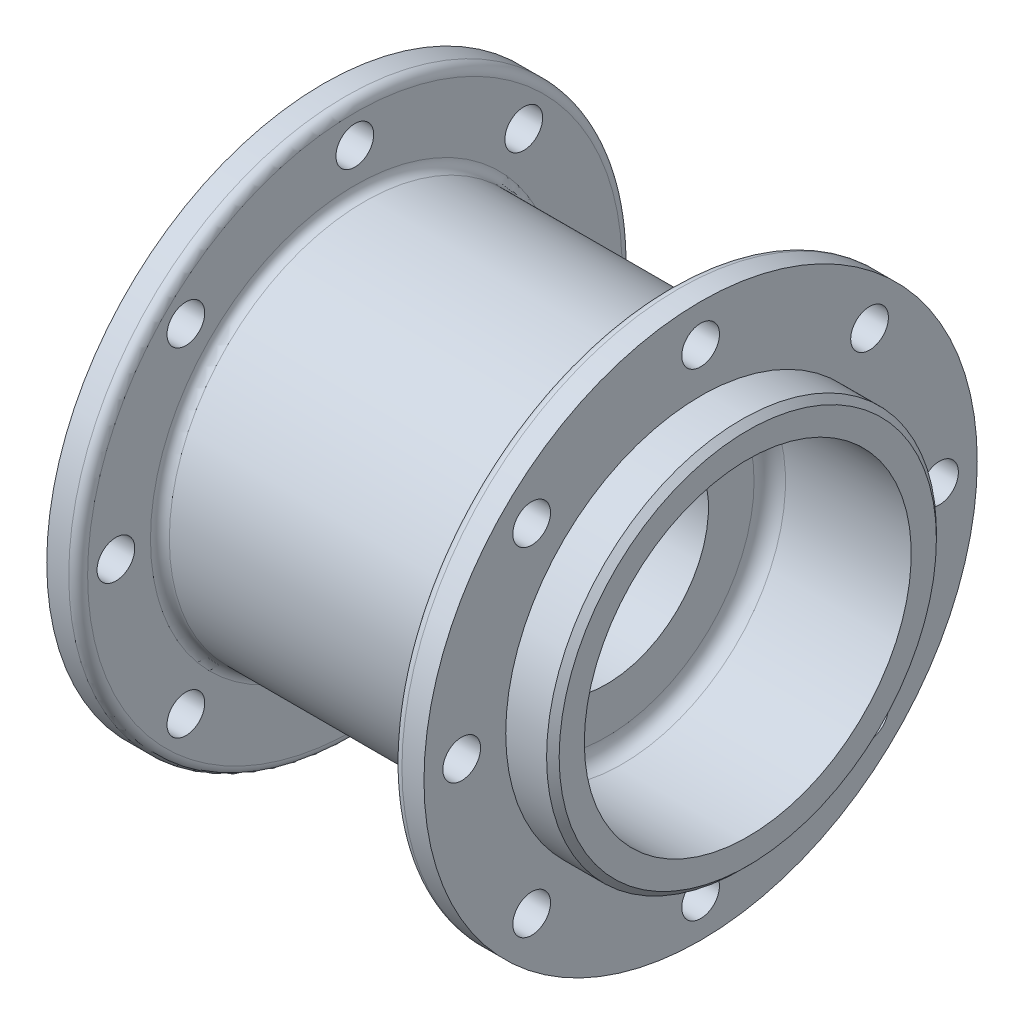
ISO-10303-21;
HEADER;
FILE_DESCRIPTION(('STEP AP214'),'2;1');
FILE_NAME('part.step','',(''),(''),'','','');
FILE_SCHEMA(('AUTOMOTIVE_DESIGN { 1 0 10303 214 1 1 1 1 }'));
ENDSEC;
DATA;
#1=APPLICATION_CONTEXT('core data for automotive mechanical design processes');
#2=APPLICATION_PROTOCOL_DEFINITION('international standard','automotive_design',2000,#1);
#3=PRODUCT_CONTEXT('',#1,'mechanical');
#4=PRODUCT('Part','Part','',(#3));
#5=PRODUCT_RELATED_PRODUCT_CATEGORY('part','',(#4));
#6=PRODUCT_DEFINITION_FORMATION('','',#4);
#7=PRODUCT_DEFINITION_CONTEXT('part definition',#1,'design');
#8=PRODUCT_DEFINITION('design','',#6,#7);
#9=PRODUCT_DEFINITION_SHAPE('','',#8);
#10=(LENGTH_UNIT() NAMED_UNIT(*) SI_UNIT(.MILLI.,.METRE.));
#11=(NAMED_UNIT(*) PLANE_ANGLE_UNIT() SI_UNIT($,.RADIAN.));
#12=(NAMED_UNIT(*) SI_UNIT($,.STERADIAN.) SOLID_ANGLE_UNIT());
#13=UNCERTAINTY_MEASURE_WITH_UNIT(LENGTH_MEASURE(1.E-05),#10,'distance_accuracy_value','');
#14=(GEOMETRIC_REPRESENTATION_CONTEXT(3) GLOBAL_UNCERTAINTY_ASSIGNED_CONTEXT((#13)) GLOBAL_UNIT_ASSIGNED_CONTEXT((#10,
#11,#12)) REPRESENTATION_CONTEXT('',''));
#15=CARTESIAN_POINT('',(0.,0.,0.));
#16=DIRECTION('',(0.,0.,1.));
#17=DIRECTION('',(1.,0.,0.));
#18=AXIS2_PLACEMENT_3D('',#15,#16,#17);
#19=CARTESIAN_POINT('',(0.,62.,0.));
#20=DIRECTION('',(1.,0.,0.));
#21=DIRECTION('',(0.,0.,-1.));
#22=AXIS2_PLACEMENT_3D('',#19,#20,#21);
#23=PLANE('',#22);
#24=CARTESIAN_POINT('',(0.,0.,0.));
#25=DIRECTION('',(1.,0.,0.));
#26=DIRECTION('',(0.,0.,-1.));
#27=AXIS2_PLACEMENT_3D('',#24,#25,#26);
#28=CIRCLE('',#27,60.0000000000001);
#29=CARTESIAN_POINT('',(0.,0.,-60.0000000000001));
#30=VERTEX_POINT('',#29);
#31=EDGE_CURVE('E81',#30,#30,#28,.F.);
#32=ORIENTED_EDGE('',*,*,#31,.T.);
#33=EDGE_LOOP('',(#32));
#34=FACE_BOUND('',#33,.T.);
#35=CARTESIAN_POINT('',(0.,0.,0.));
#36=DIRECTION('',(-1.,0.,0.));
#37=DIRECTION('',(0.,0.,1.));
#38=AXIS2_PLACEMENT_3D('',#35,#36,#37);
#39=CIRCLE('',#38,52.);
#40=CARTESIAN_POINT('',(0.,0.,52.));
#41=VERTEX_POINT('',#40);
#42=EDGE_CURVE('E84',#41,#41,#39,.T.);
#43=ORIENTED_EDGE('',*,*,#42,.F.);
#44=EDGE_LOOP('',(#43));
#45=FACE_BOUND('',#44,.T.);
#46=ADVANCED_FACE('F28',(#34,#45),#23,.F.);
#47=CARTESIAN_POINT('',(-29.1371725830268,0.,0.));
#48=DIRECTION('',(-1.,0.,0.));
#49=DIRECTION('',(0.,0.,1.));
#50=AXIS2_PLACEMENT_3D('',#47,#48,#49);
#51=CYLINDRICAL_SURFACE('',#50,52.);
#52=CARTESIAN_POINT('',(40.,0.,0.));
#53=DIRECTION('',(1.,0.,0.));
#54=DIRECTION('',(0.,0.,-1.));
#55=AXIS2_PLACEMENT_3D('',#52,#53,#54);
#56=CIRCLE('',#55,52.);
#57=CARTESIAN_POINT('',(40.,0.,-52.));
#58=VERTEX_POINT('',#57);
#59=EDGE_CURVE('E10',#58,#58,#56,.T.);
#60=ORIENTED_EDGE('',*,*,#59,.T.);
#61=EDGE_LOOP('',(#60));
#62=FACE_BOUND('',#61,.T.);
#63=ORIENTED_EDGE('',*,*,#42,.T.);
#64=EDGE_LOOP('',(#63));
#65=FACE_BOUND('',#64,.T.);
#66=ADVANCED_FACE('F243',(#62,#65),#51,.F.);
#67=CARTESIAN_POINT('',(45.,52.,0.));
#68=DIRECTION('',(1.,0.,0.));
#69=DIRECTION('',(0.,0.,-1.));
#70=AXIS2_PLACEMENT_3D('',#67,#68,#69);
#71=PLANE('',#70);
#72=CARTESIAN_POINT('',(45.,0.,0.));
#73=DIRECTION('',(1.,0.,0.));
#74=DIRECTION('',(0.,0.,-1.));
#75=AXIS2_PLACEMENT_3D('',#72,#73,#74);
#76=CIRCLE('',#75,47.);
#77=CARTESIAN_POINT('',(45.,0.,-47.));
#78=VERTEX_POINT('',#77);
#79=EDGE_CURVE('E35',#78,#78,#76,.F.);
#80=ORIENTED_EDGE('',*,*,#79,.T.);
#81=EDGE_LOOP('',(#80));
#82=FACE_BOUND('',#81,.T.);
#83=CARTESIAN_POINT('',(45.,0.,0.));
#84=DIRECTION('',(-1.,0.,0.));
#85=DIRECTION('',(0.,0.,1.));
#86=AXIS2_PLACEMENT_3D('',#83,#84,#85);
#87=CIRCLE('',#86,32.5);
#88=CARTESIAN_POINT('',(45.,0.,32.5));
#89=VERTEX_POINT('',#88);
#90=EDGE_CURVE('E87',#89,#89,#87,.T.);
#91=ORIENTED_EDGE('',*,*,#90,.F.);
#92=EDGE_LOOP('',(#91));
#93=FACE_BOUND('',#92,.T.);
#94=ADVANCED_FACE('F249',(#82,#93),#71,.F.);
#95=CARTESIAN_POINT('',(-29.1371725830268,0.,0.));
#96=DIRECTION('',(-1.,0.,0.));
#97=DIRECTION('',(0.,0.,1.));
#98=AXIS2_PLACEMENT_3D('',#95,#96,#97);
#99=CYLINDRICAL_SURFACE('',#98,32.5);
#100=CARTESIAN_POINT('',(105.,0.,0.));
#101=DIRECTION('',(-1.,0.,0.));
#102=DIRECTION('',(0.,0.,1.));
#103=AXIS2_PLACEMENT_3D('',#100,#101,#102);
#104=CIRCLE('',#103,32.5);
#105=CARTESIAN_POINT('',(105.,0.,32.5));
#106=VERTEX_POINT('',#105);
#107=EDGE_CURVE('E90',#106,#106,#104,.T.);
#108=ORIENTED_EDGE('',*,*,#107,.F.);
#109=EDGE_LOOP('',(#108));
#110=FACE_BOUND('',#109,.T.);
#111=ORIENTED_EDGE('',*,*,#90,.T.);
#112=EDGE_LOOP('',(#111));
#113=FACE_BOUND('',#112,.T.);
#114=ADVANCED_FACE('F315',(#110,#113),#99,.F.);
#115=CARTESIAN_POINT('',(105.,32.5,0.));
#116=DIRECTION('',(-1.,0.,0.));
#117=DIRECTION('',(0.,0.,1.));
#118=AXIS2_PLACEMENT_3D('',#115,#116,#117);
#119=PLANE('',#118);
#120=CARTESIAN_POINT('',(105.,0.,0.));
#121=DIRECTION('',(-1.,0.,0.));
#122=DIRECTION('',(0.,0.,1.));
#123=AXIS2_PLACEMENT_3D('',#120,#121,#122);
#124=CIRCLE('',#123,47.);
#125=CARTESIAN_POINT('',(105.,0.,47.));
#126=VERTEX_POINT('',#125);
#127=EDGE_CURVE('E39',#126,#126,#124,.F.);
#128=ORIENTED_EDGE('',*,*,#127,.T.);
#129=EDGE_LOOP('',(#128));
#130=FACE_BOUND('',#129,.T.);
#131=ORIENTED_EDGE('',*,*,#107,.T.);
#132=EDGE_LOOP('',(#131));
#133=FACE_BOUND('',#132,.T.);
#134=ADVANCED_FACE('F297',(#130,#133),#119,.F.);
#135=CARTESIAN_POINT('',(-29.1371725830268,0.,0.));
#136=DIRECTION('',(-1.,0.,0.));
#137=DIRECTION('',(0.,0.,1.));
#138=AXIS2_PLACEMENT_3D('',#135,#136,#137);
#139=CYLINDRICAL_SURFACE('',#138,52.);
#140=CARTESIAN_POINT('',(110.,0.,0.));
#141=DIRECTION('',(-1.,0.,0.));
#142=DIRECTION('',(0.,0.,1.));
#143=AXIS2_PLACEMENT_3D('',#140,#141,#142);
#144=CIRCLE('',#143,52.);
#145=CARTESIAN_POINT('',(110.,0.,52.));
#146=VERTEX_POINT('',#145);
#147=EDGE_CURVE('E43',#146,#146,#144,.T.);
#148=ORIENTED_EDGE('',*,*,#147,.T.);
#149=EDGE_LOOP('',(#148));
#150=FACE_BOUND('',#149,.T.);
#151=CARTESIAN_POINT('',(150.,0.,0.));
#152=DIRECTION('',(-1.,0.,0.));
#153=DIRECTION('',(0.,0.,1.));
#154=AXIS2_PLACEMENT_3D('',#151,#152,#153);
#155=CIRCLE('',#154,52.);
#156=CARTESIAN_POINT('',(150.,0.,52.));
#157=VERTEX_POINT('',#156);
#158=EDGE_CURVE('E93',#157,#157,#155,.T.);
#159=ORIENTED_EDGE('',*,*,#158,.F.);
#160=EDGE_LOOP('',(#159));
#161=FACE_BOUND('',#160,.T.);
#162=ADVANCED_FACE('F293',(#150,#161),#139,.F.);
#163=CARTESIAN_POINT('',(150.,62.,0.));
#164=DIRECTION('',(-1.,0.,0.));
#165=DIRECTION('',(0.,0.,1.));
#166=AXIS2_PLACEMENT_3D('',#163,#164,#165);
#167=PLANE('',#166);
#168=CARTESIAN_POINT('',(150.,0.,0.));
#169=DIRECTION('',(-1.,0.,0.));
#170=DIRECTION('',(0.,0.,1.));
#171=AXIS2_PLACEMENT_3D('',#168,#169,#170);
#172=CIRCLE('',#171,60.);
#173=CARTESIAN_POINT('',(150.,0.,60.));
#174=VERTEX_POINT('',#173);
#175=EDGE_CURVE('E72',#174,#174,#172,.F.);
#176=ORIENTED_EDGE('',*,*,#175,.T.);
#177=EDGE_LOOP('',(#176));
#178=FACE_BOUND('',#177,.T.);
#179=ORIENTED_EDGE('',*,*,#158,.T.);
#180=EDGE_LOOP('',(#179));
#181=FACE_BOUND('',#180,.T.);
#182=ADVANCED_FACE('F296',(#178,#181),#167,.F.);
#183=CARTESIAN_POINT('',(-29.1371725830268,0.,0.));
#184=DIRECTION('',(-1.,0.,0.));
#185=DIRECTION('',(0.,0.,1.));
#186=AXIS2_PLACEMENT_3D('',#183,#184,#185);
#187=CYLINDRICAL_SURFACE('',#186,62.);
#188=CARTESIAN_POINT('',(148.,0.,0.));
#189=DIRECTION('',(-1.,0.,0.));
#190=DIRECTION('',(0.,0.,1.));
#191=AXIS2_PLACEMENT_3D('',#188,#189,#190);
#192=CIRCLE('',#191,62.);
#193=CARTESIAN_POINT('',(148.,0.,62.));
#194=VERTEX_POINT('',#193);
#195=EDGE_CURVE('E75',#194,#194,#192,.T.);
#196=ORIENTED_EDGE('',*,*,#195,.T.);
#197=EDGE_LOOP('',(#196));
#198=FACE_BOUND('',#197,.T.);
#199=CARTESIAN_POINT('',(135.,0.,0.));
#200=DIRECTION('',(-1.,0.,0.));
#201=DIRECTION('',(0.,0.,1.));
#202=AXIS2_PLACEMENT_3D('',#199,#200,#201);
#203=CIRCLE('',#202,62.);
#204=CARTESIAN_POINT('',(135.,0.,62.));
#205=VERTEX_POINT('',#204);
#206=EDGE_CURVE('E96',#205,#205,#203,.T.);
#207=ORIENTED_EDGE('',*,*,#206,.F.);
#208=EDGE_LOOP('',(#207));
#209=FACE_BOUND('',#208,.T.);
#210=ADVANCED_FACE('F302',(#198,#209),#187,.T.);
#211=CARTESIAN_POINT('',(135.,88.,0.));
#212=DIRECTION('',(-1.,0.,0.));
#213=DIRECTION('',(0.,0.,1.));
#214=AXIS2_PLACEMENT_3D('',#211,#212,#213);
#215=PLANE('',#214);
#216=CARTESIAN_POINT('',(135.,0.,-76.));
#217=DIRECTION('',(-1.,0.,0.));
#218=DIRECTION('',(0.,0.,1.));
#219=AXIS2_PLACEMENT_3D('',#216,#217,#218);
#220=CIRCLE('',#219,6.);
#221=CARTESIAN_POINT('',(135.,0.,-70.));
#222=VERTEX_POINT('',#221);
#223=EDGE_CURVE('E192',#222,#222,#220,.T.);
#224=ORIENTED_EDGE('',*,*,#223,.T.);
#225=EDGE_LOOP('',(#224));
#226=FACE_BOUND('',#225,.T.);
#227=CARTESIAN_POINT('',(135.,-53.7401153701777,-53.7401153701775));
#228=DIRECTION('',(-1.,0.,0.));
#229=DIRECTION('',(0.,0.,1.));
#230=AXIS2_PLACEMENT_3D('',#227,#228,#229);
#231=CIRCLE('',#230,6.);
#232=CARTESIAN_POINT('',(135.,-53.7401153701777,-47.7401153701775));
#233=VERTEX_POINT('',#232);
#234=EDGE_CURVE('E180',#233,#233,#231,.T.);
#235=ORIENTED_EDGE('',*,*,#234,.T.);
#236=EDGE_LOOP('',(#235));
#237=FACE_BOUND('',#236,.T.);
#238=CARTESIAN_POINT('',(135.,-76.,0.));
#239=DIRECTION('',(-1.,0.,0.));
#240=DIRECTION('',(0.,0.,1.));
#241=AXIS2_PLACEMENT_3D('',#238,#239,#240);
#242=CIRCLE('',#241,6.);
#243=CARTESIAN_POINT('',(135.,-76.,6.));
#244=VERTEX_POINT('',#243);
#245=EDGE_CURVE('E168',#244,#244,#242,.T.);
#246=ORIENTED_EDGE('',*,*,#245,.T.);
#247=EDGE_LOOP('',(#246));
#248=FACE_BOUND('',#247,.T.);
#249=CARTESIAN_POINT('',(135.,-53.7401153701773,53.7401153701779));
#250=DIRECTION('',(-1.,0.,0.));
#251=DIRECTION('',(0.,0.,1.));
#252=AXIS2_PLACEMENT_3D('',#249,#250,#251);
#253=CIRCLE('',#252,6.00000000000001);
#254=CARTESIAN_POINT('',(135.,-53.7401153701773,59.7401153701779));
#255=VERTEX_POINT('',#254);
#256=EDGE_CURVE('E156',#255,#255,#253,.T.);
#257=ORIENTED_EDGE('',*,*,#256,.T.);
#258=EDGE_LOOP('',(#257));
#259=FACE_BOUND('',#258,.T.);
#260=CARTESIAN_POINT('',(135.,0.,76.));
#261=DIRECTION('',(-1.,0.,0.));
#262=DIRECTION('',(0.,0.,1.));
#263=AXIS2_PLACEMENT_3D('',#260,#261,#262);
#264=CIRCLE('',#263,6.);
#265=CARTESIAN_POINT('',(135.,0.,82.));
#266=VERTEX_POINT('',#265);
#267=EDGE_CURVE('E144',#266,#266,#264,.T.);
#268=ORIENTED_EDGE('',*,*,#267,.T.);
#269=EDGE_LOOP('',(#268));
#270=FACE_BOUND('',#269,.T.);
#271=CARTESIAN_POINT('',(135.,53.7401153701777,53.7401153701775));
#272=DIRECTION('',(-1.,0.,0.));
#273=DIRECTION('',(0.,0.,1.));
#274=AXIS2_PLACEMENT_3D('',#271,#272,#273);
#275=CIRCLE('',#274,5.99999999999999);
#276=CARTESIAN_POINT('',(135.,53.7401153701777,59.7401153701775));
#277=VERTEX_POINT('',#276);
#278=EDGE_CURVE('E132',#277,#277,#275,.T.);
#279=ORIENTED_EDGE('',*,*,#278,.T.);
#280=EDGE_LOOP('',(#279));
#281=FACE_BOUND('',#280,.T.);
#282=CARTESIAN_POINT('',(135.,76.,0.));
#283=DIRECTION('',(-1.,0.,0.));
#284=DIRECTION('',(0.,0.,1.));
#285=AXIS2_PLACEMENT_3D('',#282,#283,#284);
#286=CIRCLE('',#285,6.);
#287=CARTESIAN_POINT('',(135.,76.,6.));
#288=VERTEX_POINT('',#287);
#289=EDGE_CURVE('E120',#288,#288,#286,.T.);
#290=ORIENTED_EDGE('',*,*,#289,.T.);
#291=EDGE_LOOP('',(#290));
#292=FACE_BOUND('',#291,.T.);
#293=CARTESIAN_POINT('',(135.,53.7401153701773,-53.7401153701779));
#294=DIRECTION('',(-1.,0.,0.));
#295=DIRECTION('',(0.,0.,1.));
#296=AXIS2_PLACEMENT_3D('',#293,#294,#295);
#297=CIRCLE('',#296,5.99999999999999);
#298=CARTESIAN_POINT('',(135.,53.7401153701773,-47.7401153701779));
#299=VERTEX_POINT('',#298);
#300=EDGE_CURVE('E108',#299,#299,#297,.T.);
#301=ORIENTED_EDGE('',*,*,#300,.T.);
#302=EDGE_LOOP('',(#301));
#303=FACE_BOUND('',#302,.T.);
#304=CARTESIAN_POINT('',(135.,0.,0.));
#305=DIRECTION('',(-1.,0.,0.));
#306=DIRECTION('',(0.,0.,1.));
#307=AXIS2_PLACEMENT_3D('',#304,#305,#306);
#308=CIRCLE('',#307,88.);
#309=CARTESIAN_POINT('',(135.,0.,88.));
#310=VERTEX_POINT('',#309);
#311=EDGE_CURVE('E99',#310,#310,#308,.T.);
#312=ORIENTED_EDGE('',*,*,#311,.F.);
#313=EDGE_LOOP('',(#312));
#314=FACE_BOUND('',#313,.T.);
#315=ORIENTED_EDGE('',*,*,#206,.T.);
#316=EDGE_LOOP('',(#315));
#317=FACE_BOUND('',#316,.T.);
#318=ADVANCED_FACE('F308',(#226,#237,#248,#259,#270,#281,#292,#303,#314,#317),#215,.F.);
#319=CARTESIAN_POINT('',(-29.1371725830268,0.,0.));
#320=DIRECTION('',(-1.,0.,0.));
#321=DIRECTION('',(0.,0.,1.));
#322=AXIS2_PLACEMENT_3D('',#319,#320,#321);
#323=CYLINDRICAL_SURFACE('',#322,88.);
#324=CARTESIAN_POINT('',(128.,0.,0.));
#325=DIRECTION('',(1.,0.,0.));
#326=DIRECTION('',(0.,0.,-1.));
#327=AXIS2_PLACEMENT_3D('',#324,#325,#326);
#328=CIRCLE('',#327,88.);
#329=CARTESIAN_POINT('',(128.,0.,-88.));
#330=VERTEX_POINT('',#329);
#331=EDGE_CURVE('E63',#330,#330,#328,.T.);
#332=ORIENTED_EDGE('',*,*,#331,.T.);
#333=EDGE_LOOP('',(#332));
#334=FACE_BOUND('',#333,.T.);
#335=ORIENTED_EDGE('',*,*,#311,.T.);
#336=EDGE_LOOP('',(#335));
#337=FACE_BOUND('',#336,.T.);
#338=ADVANCED_FACE('F553',(#334,#337),#323,.T.);
#339=CARTESIAN_POINT('',(125.,62.,0.));
#340=DIRECTION('',(1.,0.,0.));
#341=DIRECTION('',(0.,0.,-1.));
#342=AXIS2_PLACEMENT_3D('',#339,#340,#341);
#343=PLANE('',#342);
#344=CARTESIAN_POINT('',(125.,0.,-76.));
#345=DIRECTION('',(1.,0.,0.));
#346=DIRECTION('',(0.,0.,-1.));
#347=AXIS2_PLACEMENT_3D('',#344,#345,#346);
#348=CIRCLE('',#347,6.);
#349=CARTESIAN_POINT('',(125.,0.,-82.));
#350=VERTEX_POINT('',#349);
#351=EDGE_CURVE('E195',#350,#350,#348,.T.);
#352=ORIENTED_EDGE('',*,*,#351,.T.);
#353=EDGE_LOOP('',(#352));
#354=FACE_BOUND('',#353,.T.);
#355=CARTESIAN_POINT('',(125.,-53.7401153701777,-53.7401153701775));
#356=DIRECTION('',(1.,0.,0.));
#357=DIRECTION('',(0.,0.,-1.));
#358=AXIS2_PLACEMENT_3D('',#355,#356,#357);
#359=CIRCLE('',#358,6.);
#360=CARTESIAN_POINT('',(125.,-53.7401153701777,-59.7401153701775));
#361=VERTEX_POINT('',#360);
#362=EDGE_CURVE('E183',#361,#361,#359,.T.);
#363=ORIENTED_EDGE('',*,*,#362,.T.);
#364=EDGE_LOOP('',(#363));
#365=FACE_BOUND('',#364,.T.);
#366=CARTESIAN_POINT('',(125.,-76.,0.));
#367=DIRECTION('',(1.,0.,0.));
#368=DIRECTION('',(0.,0.,-1.));
#369=AXIS2_PLACEMENT_3D('',#366,#367,#368);
#370=CIRCLE('',#369,6.);
#371=CARTESIAN_POINT('',(125.,-76.,-6.));
#372=VERTEX_POINT('',#371);
#373=EDGE_CURVE('E171',#372,#372,#370,.T.);
#374=ORIENTED_EDGE('',*,*,#373,.T.);
#375=EDGE_LOOP('',(#374));
#376=FACE_BOUND('',#375,.T.);
#377=CARTESIAN_POINT('',(125.,-53.7401153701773,53.7401153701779));
#378=DIRECTION('',(1.,0.,0.));
#379=DIRECTION('',(0.,0.,-1.));
#380=AXIS2_PLACEMENT_3D('',#377,#378,#379);
#381=CIRCLE('',#380,6.00000000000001);
#382=CARTESIAN_POINT('',(125.,-53.7401153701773,47.7401153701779));
#383=VERTEX_POINT('',#382);
#384=EDGE_CURVE('E159',#383,#383,#381,.T.);
#385=ORIENTED_EDGE('',*,*,#384,.T.);
#386=EDGE_LOOP('',(#385));
#387=FACE_BOUND('',#386,.T.);
#388=CARTESIAN_POINT('',(125.,0.,76.));
#389=DIRECTION('',(1.,0.,0.));
#390=DIRECTION('',(0.,0.,-1.));
#391=AXIS2_PLACEMENT_3D('',#388,#389,#390);
#392=CIRCLE('',#391,6.);
#393=CARTESIAN_POINT('',(125.,0.,70.));
#394=VERTEX_POINT('',#393);
#395=EDGE_CURVE('E147',#394,#394,#392,.T.);
#396=ORIENTED_EDGE('',*,*,#395,.T.);
#397=EDGE_LOOP('',(#396));
#398=FACE_BOUND('',#397,.T.);
#399=CARTESIAN_POINT('',(125.,53.7401153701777,53.7401153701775));
#400=DIRECTION('',(1.,0.,0.));
#401=DIRECTION('',(0.,0.,-1.));
#402=AXIS2_PLACEMENT_3D('',#399,#400,#401);
#403=CIRCLE('',#402,5.99999999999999);
#404=CARTESIAN_POINT('',(125.,53.7401153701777,47.7401153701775));
#405=VERTEX_POINT('',#404);
#406=EDGE_CURVE('E135',#405,#405,#403,.T.);
#407=ORIENTED_EDGE('',*,*,#406,.T.);
#408=EDGE_LOOP('',(#407));
#409=FACE_BOUND('',#408,.T.);
#410=CARTESIAN_POINT('',(125.,76.,0.));
#411=DIRECTION('',(1.,0.,0.));
#412=DIRECTION('',(0.,0.,-1.));
#413=AXIS2_PLACEMENT_3D('',#410,#411,#412);
#414=CIRCLE('',#413,6.);
#415=CARTESIAN_POINT('',(125.,76.,-6.));
#416=VERTEX_POINT('',#415);
#417=EDGE_CURVE('E123',#416,#416,#414,.T.);
#418=ORIENTED_EDGE('',*,*,#417,.T.);
#419=EDGE_LOOP('',(#418));
#420=FACE_BOUND('',#419,.T.);
#421=CARTESIAN_POINT('',(125.,53.7401153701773,-53.7401153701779));
#422=DIRECTION('',(1.,0.,0.));
#423=DIRECTION('',(0.,0.,-1.));
#424=AXIS2_PLACEMENT_3D('',#421,#422,#423);
#425=CIRCLE('',#424,5.99999999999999);
#426=CARTESIAN_POINT('',(125.,53.7401153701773,-59.7401153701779));
#427=VERTEX_POINT('',#426);
#428=EDGE_CURVE('E111',#427,#427,#425,.T.);
#429=ORIENTED_EDGE('',*,*,#428,.T.);
#430=EDGE_LOOP('',(#429));
#431=FACE_BOUND('',#430,.T.);
#432=CARTESIAN_POINT('',(125.,0.,0.));
#433=DIRECTION('',(1.,0.,0.));
#434=DIRECTION('',(0.,0.,-1.));
#435=AXIS2_PLACEMENT_3D('',#432,#433,#434);
#436=CIRCLE('',#435,85.);
#437=CARTESIAN_POINT('',(125.,0.,-85.));
#438=VERTEX_POINT('',#437);
#439=EDGE_CURVE('E66',#438,#438,#436,.F.);
#440=ORIENTED_EDGE('',*,*,#439,.T.);
#441=EDGE_LOOP('',(#440));
#442=FACE_BOUND('',#441,.T.);
#443=CARTESIAN_POINT('',(125.,0.,0.));
#444=DIRECTION('',(1.,0.,0.));
#445=DIRECTION('',(0.,0.,-1.));
#446=AXIS2_PLACEMENT_3D('',#443,#444,#445);
#447=CIRCLE('',#446,65.);
#448=CARTESIAN_POINT('',(125.,0.,-65.));
#449=VERTEX_POINT('',#448);
#450=EDGE_CURVE('E69',#449,#449,#447,.T.);
#451=ORIENTED_EDGE('',*,*,#450,.T.);
#452=EDGE_LOOP('',(#451));
#453=FACE_BOUND('',#452,.T.);
#454=ADVANCED_FACE('F545',(#354,#365,#376,#387,#398,#409,#420,#431,#442,#453),#343,.F.);
#455=CARTESIAN_POINT('',(-29.1371725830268,0.,0.));
#456=DIRECTION('',(-1.,0.,0.));
#457=DIRECTION('',(0.,0.,1.));
#458=AXIS2_PLACEMENT_3D('',#455,#456,#457);
#459=CYLINDRICAL_SURFACE('',#458,62.);
#460=CARTESIAN_POINT('',(122.,0.,0.));
#461=DIRECTION('',(1.,0.,0.));
#462=DIRECTION('',(0.,0.,-1.));
#463=AXIS2_PLACEMENT_3D('',#460,#461,#462);
#464=CIRCLE('',#463,62.);
#465=CARTESIAN_POINT('',(122.,0.,-62.));
#466=VERTEX_POINT('',#465);
#467=EDGE_CURVE('E48',#466,#466,#464,.F.);
#468=ORIENTED_EDGE('',*,*,#467,.T.);
#469=EDGE_LOOP('',(#468));
#470=FACE_BOUND('',#469,.T.);
#471=CARTESIAN_POINT('',(28.,0.,0.));
#472=DIRECTION('',(-1.,0.,0.));
#473=DIRECTION('',(0.,0.,1.));
#474=AXIS2_PLACEMENT_3D('',#471,#472,#473);
#475=CIRCLE('',#474,62.);
#476=CARTESIAN_POINT('',(28.,0.,62.));
#477=VERTEX_POINT('',#476);
#478=EDGE_CURVE('E51',#477,#477,#475,.F.);
#479=ORIENTED_EDGE('',*,*,#478,.T.);
#480=EDGE_LOOP('',(#479));
#481=FACE_BOUND('',#480,.T.);
#482=ADVANCED_FACE('F239',(#470,#481),#459,.T.);
#483=CARTESIAN_POINT('',(25.,88.,0.));
#484=DIRECTION('',(-1.,0.,0.));
#485=DIRECTION('',(0.,0.,1.));
#486=AXIS2_PLACEMENT_3D('',#483,#484,#485);
#487=PLANE('',#486);
#488=CARTESIAN_POINT('',(25.,0.,-76.));
#489=DIRECTION('',(-1.,0.,0.));
#490=DIRECTION('',(0.,0.,1.));
#491=AXIS2_PLACEMENT_3D('',#488,#489,#490);
#492=CIRCLE('',#491,6.);
#493=CARTESIAN_POINT('',(25.,0.,-70.));
#494=VERTEX_POINT('',#493);
#495=EDGE_CURVE('E198',#494,#494,#492,.T.);
#496=ORIENTED_EDGE('',*,*,#495,.T.);
#497=EDGE_LOOP('',(#496));
#498=FACE_BOUND('',#497,.T.);
#499=CARTESIAN_POINT('',(25.,-53.7401153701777,-53.7401153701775));
#500=DIRECTION('',(-1.,0.,0.));
#501=DIRECTION('',(0.,0.,1.));
#502=AXIS2_PLACEMENT_3D('',#499,#500,#501);
#503=CIRCLE('',#502,6.);
#504=CARTESIAN_POINT('',(25.,-53.7401153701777,-47.7401153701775));
#505=VERTEX_POINT('',#504);
#506=EDGE_CURVE('E186',#505,#505,#503,.T.);
#507=ORIENTED_EDGE('',*,*,#506,.T.);
#508=EDGE_LOOP('',(#507));
#509=FACE_BOUND('',#508,.T.);
#510=CARTESIAN_POINT('',(25.,-76.,0.));
#511=DIRECTION('',(-1.,0.,0.));
#512=DIRECTION('',(0.,0.,1.));
#513=AXIS2_PLACEMENT_3D('',#510,#511,#512);
#514=CIRCLE('',#513,6.);
#515=CARTESIAN_POINT('',(25.,-76.,6.));
#516=VERTEX_POINT('',#515);
#517=EDGE_CURVE('E174',#516,#516,#514,.T.);
#518=ORIENTED_EDGE('',*,*,#517,.T.);
#519=EDGE_LOOP('',(#518));
#520=FACE_BOUND('',#519,.T.);
#521=CARTESIAN_POINT('',(25.,-53.7401153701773,53.7401153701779));
#522=DIRECTION('',(-1.,0.,0.));
#523=DIRECTION('',(0.,0.,1.));
#524=AXIS2_PLACEMENT_3D('',#521,#522,#523);
#525=CIRCLE('',#524,6.00000000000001);
#526=CARTESIAN_POINT('',(25.,-53.7401153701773,59.7401153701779));
#527=VERTEX_POINT('',#526);
#528=EDGE_CURVE('E162',#527,#527,#525,.T.);
#529=ORIENTED_EDGE('',*,*,#528,.T.);
#530=EDGE_LOOP('',(#529));
#531=FACE_BOUND('',#530,.T.);
#532=CARTESIAN_POINT('',(25.,0.,76.));
#533=DIRECTION('',(-1.,0.,0.));
#534=DIRECTION('',(0.,0.,1.));
#535=AXIS2_PLACEMENT_3D('',#532,#533,#534);
#536=CIRCLE('',#535,6.);
#537=CARTESIAN_POINT('',(25.,0.,82.));
#538=VERTEX_POINT('',#537);
#539=EDGE_CURVE('E150',#538,#538,#536,.T.);
#540=ORIENTED_EDGE('',*,*,#539,.T.);
#541=EDGE_LOOP('',(#540));
#542=FACE_BOUND('',#541,.T.);
#543=CARTESIAN_POINT('',(25.,53.7401153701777,53.7401153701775));
#544=DIRECTION('',(-1.,0.,0.));
#545=DIRECTION('',(0.,0.,1.));
#546=AXIS2_PLACEMENT_3D('',#543,#544,#545);
#547=CIRCLE('',#546,5.99999999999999);
#548=CARTESIAN_POINT('',(25.,53.7401153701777,59.7401153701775));
#549=VERTEX_POINT('',#548);
#550=EDGE_CURVE('E138',#549,#549,#547,.T.);
#551=ORIENTED_EDGE('',*,*,#550,.T.);
#552=EDGE_LOOP('',(#551));
#553=FACE_BOUND('',#552,.T.);
#554=CARTESIAN_POINT('',(25.,76.,0.));
#555=DIRECTION('',(-1.,0.,0.));
#556=DIRECTION('',(0.,0.,1.));
#557=AXIS2_PLACEMENT_3D('',#554,#555,#556);
#558=CIRCLE('',#557,6.);
#559=CARTESIAN_POINT('',(25.,76.,6.));
#560=VERTEX_POINT('',#559);
#561=EDGE_CURVE('E126',#560,#560,#558,.T.);
#562=ORIENTED_EDGE('',*,*,#561,.T.);
#563=EDGE_LOOP('',(#562));
#564=FACE_BOUND('',#563,.T.);
#565=CARTESIAN_POINT('',(25.,53.7401153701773,-53.7401153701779));
#566=DIRECTION('',(-1.,0.,0.));
#567=DIRECTION('',(0.,0.,1.));
#568=AXIS2_PLACEMENT_3D('',#565,#566,#567);
#569=CIRCLE('',#568,5.99999999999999);
#570=CARTESIAN_POINT('',(25.,53.7401153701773,-47.7401153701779));
#571=VERTEX_POINT('',#570);
#572=EDGE_CURVE('E114',#571,#571,#569,.T.);
#573=ORIENTED_EDGE('',*,*,#572,.T.);
#574=EDGE_LOOP('',(#573));
#575=FACE_BOUND('',#574,.T.);
#576=CARTESIAN_POINT('',(25.,0.,0.));
#577=DIRECTION('',(-1.,0.,0.));
#578=DIRECTION('',(0.,0.,1.));
#579=AXIS2_PLACEMENT_3D('',#576,#577,#578);
#580=CIRCLE('',#579,85.);
#581=CARTESIAN_POINT('',(25.,0.,85.));
#582=VERTEX_POINT('',#581);
#583=EDGE_CURVE('E54',#582,#582,#580,.F.);
#584=ORIENTED_EDGE('',*,*,#583,.T.);
#585=EDGE_LOOP('',(#584));
#586=FACE_BOUND('',#585,.T.);
#587=CARTESIAN_POINT('',(25.,0.,0.));
#588=DIRECTION('',(-1.,0.,0.));
#589=DIRECTION('',(0.,0.,1.));
#590=AXIS2_PLACEMENT_3D('',#587,#588,#589);
#591=CIRCLE('',#590,65.);
#592=CARTESIAN_POINT('',(25.,0.,65.));
#593=VERTEX_POINT('',#592);
#594=EDGE_CURVE('E57',#593,#593,#591,.T.);
#595=ORIENTED_EDGE('',*,*,#594,.T.);
#596=EDGE_LOOP('',(#595));
#597=FACE_BOUND('',#596,.T.);
#598=ADVANCED_FACE('F233',(#498,#509,#520,#531,#542,#553,#564,#575,#586,#597),#487,.F.);
#599=CARTESIAN_POINT('',(-29.1371725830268,0.,0.));
#600=DIRECTION('',(-1.,0.,0.));
#601=DIRECTION('',(0.,0.,1.));
#602=AXIS2_PLACEMENT_3D('',#599,#600,#601);
#603=CYLINDRICAL_SURFACE('',#602,88.);
#604=CARTESIAN_POINT('',(22.,0.,0.));
#605=DIRECTION('',(-1.,0.,0.));
#606=DIRECTION('',(0.,0.,1.));
#607=AXIS2_PLACEMENT_3D('',#604,#605,#606);
#608=CIRCLE('',#607,88.);
#609=CARTESIAN_POINT('',(22.,0.,88.));
#610=VERTEX_POINT('',#609);
#611=EDGE_CURVE('E60',#610,#610,#608,.T.);
#612=ORIENTED_EDGE('',*,*,#611,.T.);
#613=EDGE_LOOP('',(#612));
#614=FACE_BOUND('',#613,.T.);
#615=CARTESIAN_POINT('',(15.,0.,0.));
#616=DIRECTION('',(-1.,0.,0.));
#617=DIRECTION('',(0.,0.,1.));
#618=AXIS2_PLACEMENT_3D('',#615,#616,#617);
#619=CIRCLE('',#618,88.);
#620=CARTESIAN_POINT('',(15.,0.,88.));
#621=VERTEX_POINT('',#620);
#622=EDGE_CURVE('E102',#621,#621,#619,.T.);
#623=ORIENTED_EDGE('',*,*,#622,.F.);
#624=EDGE_LOOP('',(#623));
#625=FACE_BOUND('',#624,.T.);
#626=ADVANCED_FACE('F212',(#614,#625),#603,.T.);
#627=CARTESIAN_POINT('',(15.,62.,0.));
#628=DIRECTION('',(1.,0.,0.));
#629=DIRECTION('',(0.,0.,-1.));
#630=AXIS2_PLACEMENT_3D('',#627,#628,#629);
#631=PLANE('',#630);
#632=CARTESIAN_POINT('',(15.,0.,-76.));
#633=DIRECTION('',(-1.,0.,0.));
#634=DIRECTION('',(0.,0.,1.));
#635=AXIS2_PLACEMENT_3D('',#632,#633,#634);
#636=CIRCLE('',#635,6.);
#637=CARTESIAN_POINT('',(15.,0.,-70.));
#638=VERTEX_POINT('',#637);
#639=EDGE_CURVE('E201',#638,#638,#636,.T.);
#640=ORIENTED_EDGE('',*,*,#639,.F.);
#641=EDGE_LOOP('',(#640));
#642=FACE_BOUND('',#641,.T.);
#643=CARTESIAN_POINT('',(15.,-53.7401153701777,-53.7401153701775));
#644=DIRECTION('',(-1.,0.,0.));
#645=DIRECTION('',(0.,0.,1.));
#646=AXIS2_PLACEMENT_3D('',#643,#644,#645);
#647=CIRCLE('',#646,6.);
#648=CARTESIAN_POINT('',(15.,-53.7401153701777,-47.7401153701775));
#649=VERTEX_POINT('',#648);
#650=EDGE_CURVE('E189',#649,#649,#647,.T.);
#651=ORIENTED_EDGE('',*,*,#650,.F.);
#652=EDGE_LOOP('',(#651));
#653=FACE_BOUND('',#652,.T.);
#654=CARTESIAN_POINT('',(15.,-76.,0.));
#655=DIRECTION('',(-1.,0.,0.));
#656=DIRECTION('',(0.,0.,1.));
#657=AXIS2_PLACEMENT_3D('',#654,#655,#656);
#658=CIRCLE('',#657,6.);
#659=CARTESIAN_POINT('',(15.,-76.,6.));
#660=VERTEX_POINT('',#659);
#661=EDGE_CURVE('E177',#660,#660,#658,.T.);
#662=ORIENTED_EDGE('',*,*,#661,.F.);
#663=EDGE_LOOP('',(#662));
#664=FACE_BOUND('',#663,.T.);
#665=CARTESIAN_POINT('',(15.,-53.7401153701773,53.7401153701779));
#666=DIRECTION('',(-1.,0.,0.));
#667=DIRECTION('',(0.,0.,1.));
#668=AXIS2_PLACEMENT_3D('',#665,#666,#667);
#669=CIRCLE('',#668,6.00000000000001);
#670=CARTESIAN_POINT('',(15.,-53.7401153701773,59.7401153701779));
#671=VERTEX_POINT('',#670);
#672=EDGE_CURVE('E165',#671,#671,#669,.T.);
#673=ORIENTED_EDGE('',*,*,#672,.F.);
#674=EDGE_LOOP('',(#673));
#675=FACE_BOUND('',#674,.T.);
#676=CARTESIAN_POINT('',(15.,0.,76.));
#677=DIRECTION('',(-1.,0.,0.));
#678=DIRECTION('',(0.,0.,1.));
#679=AXIS2_PLACEMENT_3D('',#676,#677,#678);
#680=CIRCLE('',#679,6.);
#681=CARTESIAN_POINT('',(15.,0.,82.));
#682=VERTEX_POINT('',#681);
#683=EDGE_CURVE('E153',#682,#682,#680,.T.);
#684=ORIENTED_EDGE('',*,*,#683,.F.);
#685=EDGE_LOOP('',(#684));
#686=FACE_BOUND('',#685,.T.);
#687=CARTESIAN_POINT('',(15.,53.7401153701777,53.7401153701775));
#688=DIRECTION('',(-1.,0.,0.));
#689=DIRECTION('',(0.,0.,1.));
#690=AXIS2_PLACEMENT_3D('',#687,#688,#689);
#691=CIRCLE('',#690,5.99999999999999);
#692=CARTESIAN_POINT('',(15.,53.7401153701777,59.7401153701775));
#693=VERTEX_POINT('',#692);
#694=EDGE_CURVE('E141',#693,#693,#691,.T.);
#695=ORIENTED_EDGE('',*,*,#694,.F.);
#696=EDGE_LOOP('',(#695));
#697=FACE_BOUND('',#696,.T.);
#698=CARTESIAN_POINT('',(15.,76.,0.));
#699=DIRECTION('',(-1.,0.,0.));
#700=DIRECTION('',(0.,0.,1.));
#701=AXIS2_PLACEMENT_3D('',#698,#699,#700);
#702=CIRCLE('',#701,6.);
#703=CARTESIAN_POINT('',(15.,76.,6.));
#704=VERTEX_POINT('',#703);
#705=EDGE_CURVE('E129',#704,#704,#702,.T.);
#706=ORIENTED_EDGE('',*,*,#705,.F.);
#707=EDGE_LOOP('',(#706));
#708=FACE_BOUND('',#707,.T.);
#709=CARTESIAN_POINT('',(15.,53.7401153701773,-53.7401153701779));
#710=DIRECTION('',(-1.,0.,0.));
#711=DIRECTION('',(0.,0.,1.));
#712=AXIS2_PLACEMENT_3D('',#709,#710,#711);
#713=CIRCLE('',#712,5.99999999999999);
#714=CARTESIAN_POINT('',(15.,53.7401153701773,-47.7401153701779));
#715=VERTEX_POINT('',#714);
#716=EDGE_CURVE('E117',#715,#715,#713,.T.);
#717=ORIENTED_EDGE('',*,*,#716,.F.);
#718=EDGE_LOOP('',(#717));
#719=FACE_BOUND('',#718,.T.);
#720=CARTESIAN_POINT('',(15.,0.,0.));
#721=DIRECTION('',(-1.,0.,0.));
#722=DIRECTION('',(0.,0.,1.));
#723=AXIS2_PLACEMENT_3D('',#720,#721,#722);
#724=CIRCLE('',#723,62.);
#725=CARTESIAN_POINT('',(15.,0.,62.));
#726=VERTEX_POINT('',#725);
#727=EDGE_CURVE('E105',#726,#726,#724,.T.);
#728=ORIENTED_EDGE('',*,*,#727,.F.);
#729=EDGE_LOOP('',(#728));
#730=FACE_BOUND('',#729,.T.);
#731=ORIENTED_EDGE('',*,*,#622,.T.);
#732=EDGE_LOOP('',(#731));
#733=FACE_BOUND('',#732,.T.);
#734=ADVANCED_FACE('F208',(#642,#653,#664,#675,#686,#697,#708,#719,#730,#733),#631,.F.);
#735=CARTESIAN_POINT('',(-29.1371725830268,0.,0.));
#736=DIRECTION('',(-1.,0.,0.));
#737=DIRECTION('',(0.,0.,1.));
#738=AXIS2_PLACEMENT_3D('',#735,#736,#737);
#739=CYLINDRICAL_SURFACE('',#738,62.);
#740=CARTESIAN_POINT('',(1.99999999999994,0.,0.));
#741=DIRECTION('',(1.,0.,0.));
#742=DIRECTION('',(0.,0.,-1.));
#743=AXIS2_PLACEMENT_3D('',#740,#741,#742);
#744=CIRCLE('',#743,62.);
#745=CARTESIAN_POINT('',(1.99999999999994,0.,-62.));
#746=VERTEX_POINT('',#745);
#747=EDGE_CURVE('E78',#746,#746,#744,.T.);
#748=ORIENTED_EDGE('',*,*,#747,.T.);
#749=EDGE_LOOP('',(#748));
#750=FACE_BOUND('',#749,.T.);
#751=ORIENTED_EDGE('',*,*,#727,.T.);
#752=EDGE_LOOP('',(#751));
#753=FACE_BOUND('',#752,.T.);
#754=ADVANCED_FACE('F211',(#750,#753),#739,.T.);
#755=CARTESIAN_POINT('',(0.,0.,0.));
#756=DIRECTION('',(1.,0.,0.));
#757=DIRECTION('',(0.,0.,-1.));
#758=AXIS2_PLACEMENT_3D('',#755,#756,#757);
#759=CONICAL_SURFACE('',#758,60.0000000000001,0.785398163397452);
#760=ORIENTED_EDGE('',*,*,#747,.F.);
#761=EDGE_LOOP('',(#760));
#762=FACE_BOUND('',#761,.T.);
#763=ORIENTED_EDGE('',*,*,#31,.F.);
#764=EDGE_LOOP('',(#763));
#765=FACE_BOUND('',#764,.T.);
#766=ADVANCED_FACE('F254',(#762,#765),#759,.T.);
#767=CARTESIAN_POINT('',(148.,0.,0.));
#768=DIRECTION('',(-1.,0.,0.));
#769=DIRECTION('',(0.,0.,1.));
#770=AXIS2_PLACEMENT_3D('',#767,#768,#769);
#771=CONICAL_SURFACE('',#770,62.,0.785398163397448);
#772=ORIENTED_EDGE('',*,*,#175,.F.);
#773=EDGE_LOOP('',(#772));
#774=FACE_BOUND('',#773,.T.);
#775=ORIENTED_EDGE('',*,*,#195,.F.);
#776=EDGE_LOOP('',(#775));
#777=FACE_BOUND('',#776,.T.);
#778=ADVANCED_FACE('F257',(#774,#777),#771,.T.);
#779=CARTESIAN_POINT('',(128.,0.,0.));
#780=DIRECTION('',(1.,0.,0.));
#781=DIRECTION('',(0.,0.,-1.));
#782=AXIS2_PLACEMENT_3D('',#779,#780,#781);
#783=TOROIDAL_SURFACE('',#782,85.,3.);
#784=ORIENTED_EDGE('',*,*,#331,.F.);
#785=EDGE_LOOP('',(#784));
#786=FACE_BOUND('',#785,.T.);
#787=ORIENTED_EDGE('',*,*,#439,.F.);
#788=EDGE_LOOP('',(#787));
#789=FACE_BOUND('',#788,.T.);
#790=ADVANCED_FACE('F261',(#786,#789),#783,.T.);
#791=CARTESIAN_POINT('',(22.,0.,0.));
#792=DIRECTION('',(-1.,0.,0.));
#793=DIRECTION('',(0.,0.,1.));
#794=AXIS2_PLACEMENT_3D('',#791,#792,#793);
#795=TOROIDAL_SURFACE('',#794,85.,3.);
#796=ORIENTED_EDGE('',*,*,#583,.F.);
#797=EDGE_LOOP('',(#796));
#798=FACE_BOUND('',#797,.T.);
#799=ORIENTED_EDGE('',*,*,#611,.F.);
#800=EDGE_LOOP('',(#799));
#801=FACE_BOUND('',#800,.T.);
#802=ADVANCED_FACE('F265',(#798,#801),#795,.T.);
#803=CARTESIAN_POINT('',(122.,0.,0.));
#804=DIRECTION('',(1.,0.,0.));
#805=DIRECTION('',(0.,0.,-1.));
#806=AXIS2_PLACEMENT_3D('',#803,#804,#805);
#807=TOROIDAL_SURFACE('',#806,65.,3.);
#808=ORIENTED_EDGE('',*,*,#450,.F.);
#809=EDGE_LOOP('',(#808));
#810=FACE_BOUND('',#809,.T.);
#811=ORIENTED_EDGE('',*,*,#467,.F.);
#812=EDGE_LOOP('',(#811));
#813=FACE_BOUND('',#812,.T.);
#814=ADVANCED_FACE('F269',(#810,#813),#807,.F.);
#815=CARTESIAN_POINT('',(28.,0.,0.));
#816=DIRECTION('',(-1.,0.,0.));
#817=DIRECTION('',(0.,0.,1.));
#818=AXIS2_PLACEMENT_3D('',#815,#816,#817);
#819=TOROIDAL_SURFACE('',#818,65.,3.);
#820=ORIENTED_EDGE('',*,*,#478,.F.);
#821=EDGE_LOOP('',(#820));
#822=FACE_BOUND('',#821,.T.);
#823=ORIENTED_EDGE('',*,*,#594,.F.);
#824=EDGE_LOOP('',(#823));
#825=FACE_BOUND('',#824,.T.);
#826=ADVANCED_FACE('F273',(#822,#825),#819,.F.);
#827=CARTESIAN_POINT('',(150.,53.7401153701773,-53.7401153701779));
#828=DIRECTION('',(-1.,0.,0.));
#829=DIRECTION('',(0.,0.,1.));
#830=AXIS2_PLACEMENT_3D('',#827,#828,#829);
#831=CYLINDRICAL_SURFACE('',#830,5.99999999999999);
#832=ORIENTED_EDGE('',*,*,#716,.T.);
#833=EDGE_LOOP('',(#832));
#834=FACE_BOUND('',#833,.T.);
#835=ORIENTED_EDGE('',*,*,#572,.F.);
#836=EDGE_LOOP('',(#835));
#837=FACE_BOUND('',#836,.T.);
#838=ADVANCED_FACE('F276',(#834,#837),#831,.F.);
#839=ORIENTED_EDGE('',*,*,#428,.F.);
#840=EDGE_LOOP('',(#839));
#841=FACE_BOUND('',#840,.T.);
#842=ORIENTED_EDGE('',*,*,#300,.F.);
#843=EDGE_LOOP('',(#842));
#844=FACE_BOUND('',#843,.T.);
#845=ADVANCED_FACE('F466',(#841,#844),#831,.F.);
#846=CARTESIAN_POINT('',(150.,76.,0.));
#847=DIRECTION('',(-1.,0.,0.));
#848=DIRECTION('',(0.,0.,1.));
#849=AXIS2_PLACEMENT_3D('',#846,#847,#848);
#850=CYLINDRICAL_SURFACE('',#849,6.);
#851=ORIENTED_EDGE('',*,*,#705,.T.);
#852=EDGE_LOOP('',(#851));
#853=FACE_BOUND('',#852,.T.);
#854=ORIENTED_EDGE('',*,*,#561,.F.);
#855=EDGE_LOOP('',(#854));
#856=FACE_BOUND('',#855,.T.);
#857=ADVANCED_FACE('F457',(#853,#856),#850,.F.);
#858=ORIENTED_EDGE('',*,*,#417,.F.);
#859=EDGE_LOOP('',(#858));
#860=FACE_BOUND('',#859,.T.);
#861=ORIENTED_EDGE('',*,*,#289,.F.);
#862=EDGE_LOOP('',(#861));
#863=FACE_BOUND('',#862,.T.);
#864=ADVANCED_FACE('F449',(#860,#863),#850,.F.);
#865=CARTESIAN_POINT('',(150.,53.7401153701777,53.7401153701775));
#866=DIRECTION('',(-1.,0.,0.));
#867=DIRECTION('',(0.,0.,1.));
#868=AXIS2_PLACEMENT_3D('',#865,#866,#867);
#869=CYLINDRICAL_SURFACE('',#868,5.99999999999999);
#870=ORIENTED_EDGE('',*,*,#694,.T.);
#871=EDGE_LOOP('',(#870));
#872=FACE_BOUND('',#871,.T.);
#873=ORIENTED_EDGE('',*,*,#550,.F.);
#874=EDGE_LOOP('',(#873));
#875=FACE_BOUND('',#874,.T.);
#876=ADVANCED_FACE('F440',(#872,#875),#869,.F.);
#877=ORIENTED_EDGE('',*,*,#406,.F.);
#878=EDGE_LOOP('',(#877));
#879=FACE_BOUND('',#878,.T.);
#880=ORIENTED_EDGE('',*,*,#278,.F.);
#881=EDGE_LOOP('',(#880));
#882=FACE_BOUND('',#881,.T.);
#883=ADVANCED_FACE('F432',(#879,#882),#869,.F.);
#884=CARTESIAN_POINT('',(150.,0.,76.));
#885=DIRECTION('',(-1.,0.,0.));
#886=DIRECTION('',(0.,0.,1.));
#887=AXIS2_PLACEMENT_3D('',#884,#885,#886);
#888=CYLINDRICAL_SURFACE('',#887,6.);
#889=ORIENTED_EDGE('',*,*,#683,.T.);
#890=EDGE_LOOP('',(#889));
#891=FACE_BOUND('',#890,.T.);
#892=ORIENTED_EDGE('',*,*,#539,.F.);
#893=EDGE_LOOP('',(#892));
#894=FACE_BOUND('',#893,.T.);
#895=ADVANCED_FACE('F423',(#891,#894),#888,.F.);
#896=ORIENTED_EDGE('',*,*,#395,.F.);
#897=EDGE_LOOP('',(#896));
#898=FACE_BOUND('',#897,.T.);
#899=ORIENTED_EDGE('',*,*,#267,.F.);
#900=EDGE_LOOP('',(#899));
#901=FACE_BOUND('',#900,.T.);
#902=ADVANCED_FACE('F415',(#898,#901),#888,.F.);
#903=CARTESIAN_POINT('',(150.,-53.7401153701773,53.7401153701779));
#904=DIRECTION('',(-1.,0.,0.));
#905=DIRECTION('',(0.,0.,1.));
#906=AXIS2_PLACEMENT_3D('',#903,#904,#905);
#907=CYLINDRICAL_SURFACE('',#906,6.00000000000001);
#908=ORIENTED_EDGE('',*,*,#672,.T.);
#909=EDGE_LOOP('',(#908));
#910=FACE_BOUND('',#909,.T.);
#911=ORIENTED_EDGE('',*,*,#528,.F.);
#912=EDGE_LOOP('',(#911));
#913=FACE_BOUND('',#912,.T.);
#914=ADVANCED_FACE('F406',(#910,#913),#907,.F.);
#915=ORIENTED_EDGE('',*,*,#384,.F.);
#916=EDGE_LOOP('',(#915));
#917=FACE_BOUND('',#916,.T.);
#918=ORIENTED_EDGE('',*,*,#256,.F.);
#919=EDGE_LOOP('',(#918));
#920=FACE_BOUND('',#919,.T.);
#921=ADVANCED_FACE('F398',(#917,#920),#907,.F.);
#922=CARTESIAN_POINT('',(150.,-76.,0.));
#923=DIRECTION('',(-1.,0.,0.));
#924=DIRECTION('',(0.,0.,1.));
#925=AXIS2_PLACEMENT_3D('',#922,#923,#924);
#926=CYLINDRICAL_SURFACE('',#925,6.);
#927=ORIENTED_EDGE('',*,*,#661,.T.);
#928=EDGE_LOOP('',(#927));
#929=FACE_BOUND('',#928,.T.);
#930=ORIENTED_EDGE('',*,*,#517,.F.);
#931=EDGE_LOOP('',(#930));
#932=FACE_BOUND('',#931,.T.);
#933=ADVANCED_FACE('F389',(#929,#932),#926,.F.);
#934=ORIENTED_EDGE('',*,*,#373,.F.);
#935=EDGE_LOOP('',(#934));
#936=FACE_BOUND('',#935,.T.);
#937=ORIENTED_EDGE('',*,*,#245,.F.);
#938=EDGE_LOOP('',(#937));
#939=FACE_BOUND('',#938,.T.);
#940=ADVANCED_FACE('F381',(#936,#939),#926,.F.);
#941=CARTESIAN_POINT('',(150.,-53.7401153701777,-53.7401153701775));
#942=DIRECTION('',(-1.,0.,0.));
#943=DIRECTION('',(0.,0.,1.));
#944=AXIS2_PLACEMENT_3D('',#941,#942,#943);
#945=CYLINDRICAL_SURFACE('',#944,6.);
#946=ORIENTED_EDGE('',*,*,#650,.T.);
#947=EDGE_LOOP('',(#946));
#948=FACE_BOUND('',#947,.T.);
#949=ORIENTED_EDGE('',*,*,#506,.F.);
#950=EDGE_LOOP('',(#949));
#951=FACE_BOUND('',#950,.T.);
#952=ADVANCED_FACE('F372',(#948,#951),#945,.F.);
#953=ORIENTED_EDGE('',*,*,#362,.F.);
#954=EDGE_LOOP('',(#953));
#955=FACE_BOUND('',#954,.T.);
#956=ORIENTED_EDGE('',*,*,#234,.F.);
#957=EDGE_LOOP('',(#956));
#958=FACE_BOUND('',#957,.T.);
#959=ADVANCED_FACE('F365',(#955,#958),#945,.F.);
#960=CARTESIAN_POINT('',(150.,0.,-76.));
#961=DIRECTION('',(-1.,0.,0.));
#962=DIRECTION('',(0.,0.,1.));
#963=AXIS2_PLACEMENT_3D('',#960,#961,#962);
#964=CYLINDRICAL_SURFACE('',#963,6.);
#965=ORIENTED_EDGE('',*,*,#639,.T.);
#966=EDGE_LOOP('',(#965));
#967=FACE_BOUND('',#966,.T.);
#968=ORIENTED_EDGE('',*,*,#495,.F.);
#969=EDGE_LOOP('',(#968));
#970=FACE_BOUND('',#969,.T.);
#971=ADVANCED_FACE('F205',(#967,#970),#964,.F.);
#972=ORIENTED_EDGE('',*,*,#351,.F.);
#973=EDGE_LOOP('',(#972));
#974=FACE_BOUND('',#973,.T.);
#975=ORIENTED_EDGE('',*,*,#223,.F.);
#976=EDGE_LOOP('',(#975));
#977=FACE_BOUND('',#976,.T.);
#978=ADVANCED_FACE('F280',(#974,#977),#964,.F.);
#979=CARTESIAN_POINT('',(110.,0.,0.));
#980=DIRECTION('',(-1.,0.,0.));
#981=DIRECTION('',(0.,0.,1.));
#982=AXIS2_PLACEMENT_3D('',#979,#980,#981);
#983=TOROIDAL_SURFACE('',#982,47.,5.);
#984=ORIENTED_EDGE('',*,*,#127,.F.);
#985=EDGE_LOOP('',(#984));
#986=FACE_BOUND('',#985,.T.);
#987=ORIENTED_EDGE('',*,*,#147,.F.);
#988=EDGE_LOOP('',(#987));
#989=FACE_BOUND('',#988,.T.);
#990=ADVANCED_FACE('F278',(#986,#989),#983,.F.);
#991=CARTESIAN_POINT('',(40.,0.,0.));
#992=DIRECTION('',(1.,0.,0.));
#993=DIRECTION('',(0.,0.,-1.));
#994=AXIS2_PLACEMENT_3D('',#991,#992,#993);
#995=TOROIDAL_SURFACE('',#994,47.,5.);
#996=ORIENTED_EDGE('',*,*,#59,.F.);
#997=EDGE_LOOP('',(#996));
#998=FACE_BOUND('',#997,.T.);
#999=ORIENTED_EDGE('',*,*,#79,.F.);
#1000=EDGE_LOOP('',(#999));
#1001=FACE_BOUND('',#1000,.T.);
#1002=ADVANCED_FACE('F30',(#998,#1001),#995,.F.);
#1003=CLOSED_SHELL('',(#46,#66,#94,#114,#134,#162,#182,#210,#318,#338,#454,#482,#598,#626,#734,
#754,#766,#778,#790,#802,#814,#826,#838,#845,#857,#864,#876,#883,#895,#902,#914,#921,#933,#940,
#952,#959,#971,#978,#990,#1002));
#1004=MANIFOLD_SOLID_BREP('B2',#1003);
#1005=ADVANCED_BREP_SHAPE_REPRESENTATION('',(#18,#1004),#14);
#1006=SHAPE_DEFINITION_REPRESENTATION(#9,#1005);
ENDSEC;
END-ISO-10303-21;
